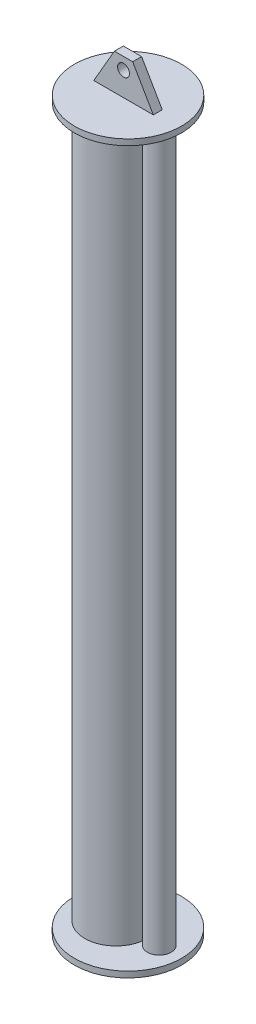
ISO-10303-21;
HEADER;
FILE_DESCRIPTION(('STEP AP214'),'2;1');
FILE_NAME('part.step','',(''),(''),'','','');
FILE_SCHEMA(('AUTOMOTIVE_DESIGN { 1 0 10303 214 1 1 1 1 }'));
ENDSEC;
DATA;
#1=APPLICATION_CONTEXT('core data for automotive mechanical design processes');
#2=APPLICATION_PROTOCOL_DEFINITION('international standard','automotive_design',2000,#1);
#3=PRODUCT_CONTEXT('',#1,'mechanical');
#4=PRODUCT('Part','Part','',(#3));
#5=PRODUCT_RELATED_PRODUCT_CATEGORY('part','',(#4));
#6=PRODUCT_DEFINITION_FORMATION('','',#4);
#7=PRODUCT_DEFINITION_CONTEXT('part definition',#1,'design');
#8=PRODUCT_DEFINITION('design','',#6,#7);
#9=PRODUCT_DEFINITION_SHAPE('','',#8);
#10=(LENGTH_UNIT() NAMED_UNIT(*) SI_UNIT(.MILLI.,.METRE.));
#11=(NAMED_UNIT(*) PLANE_ANGLE_UNIT() SI_UNIT($,.RADIAN.));
#12=(NAMED_UNIT(*) SI_UNIT($,.STERADIAN.) SOLID_ANGLE_UNIT());
#13=UNCERTAINTY_MEASURE_WITH_UNIT(LENGTH_MEASURE(1.E-05),#10,'distance_accuracy_value','');
#14=(GEOMETRIC_REPRESENTATION_CONTEXT(3) GLOBAL_UNCERTAINTY_ASSIGNED_CONTEXT((#13)) GLOBAL_UNIT_ASSIGNED_CONTEXT((#10,
#11,#12)) REPRESENTATION_CONTEXT('',''));
#15=CARTESIAN_POINT('',(0.,0.,0.));
#16=DIRECTION('',(0.,0.,1.));
#17=DIRECTION('',(1.,0.,0.));
#18=AXIS2_PLACEMENT_3D('',#15,#16,#17);
#19=CARTESIAN_POINT('',(-57.5785408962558,1536.7,0.));
#20=DIRECTION('',(0.,1.,0.));
#21=DIRECTION('',(0.,0.,1.));
#22=AXIS2_PLACEMENT_3D('',#19,#20,#21);
#23=PLANE('',#22);
#24=CARTESIAN_POINT('',(-57.5785408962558,1536.7,0.));
#25=DIRECTION('',(0.,1.,0.));
#26=DIRECTION('',(0.,0.,1.));
#27=AXIS2_PLACEMENT_3D('',#24,#25,#26);
#28=CIRCLE('',#27,114.3);
#29=CARTESIAN_POINT('',(-57.5785408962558,1536.7,114.3));
#30=VERTEX_POINT('',#29);
#31=EDGE_CURVE('E148',#30,#30,#28,.T.);
#32=ORIENTED_EDGE('',*,*,#31,.T.);
#33=EDGE_LOOP('',(#32));
#34=FACE_BOUND('',#33,.T.);
#35=DIRECTION('',(1.,0.,0.));
#36=VECTOR('',#35,1.);
#37=CARTESIAN_POINT('',(5.92145910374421,1536.7,9.525));
#38=LINE('',#37,#36);
#39=CARTESIAN_POINT('',(-121.078540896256,1536.7,9.525));
#40=VERTEX_POINT('',#39);
#41=CARTESIAN_POINT('',(5.92145910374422,1536.7,9.525));
#42=VERTEX_POINT('',#41);
#43=EDGE_CURVE('E110',#40,#42,#38,.T.);
#44=ORIENTED_EDGE('',*,*,#43,.F.);
#45=DIRECTION('',(0.,0.,-1.));
#46=VECTOR('',#45,1.);
#47=CARTESIAN_POINT('',(-121.078540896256,1536.7,9.525));
#48=LINE('',#47,#46);
#49=CARTESIAN_POINT('',(-121.078540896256,1536.7,-9.525));
#50=VERTEX_POINT('',#49);
#51=EDGE_CURVE('E121',#40,#50,#48,.T.);
#52=ORIENTED_EDGE('',*,*,#51,.T.);
#53=DIRECTION('',(1.,0.,0.));
#54=VECTOR('',#53,1.);
#55=CARTESIAN_POINT('',(5.92145910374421,1536.7,-9.525));
#56=LINE('',#55,#54);
#57=CARTESIAN_POINT('',(5.92145910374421,1536.7,-9.525));
#58=VERTEX_POINT('',#57);
#59=EDGE_CURVE('E137',#50,#58,#56,.T.);
#60=ORIENTED_EDGE('',*,*,#59,.T.);
#61=DIRECTION('',(0.,0.,-1.));
#62=VECTOR('',#61,1.);
#63=CARTESIAN_POINT('',(5.92145910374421,1536.7,9.525));
#64=LINE('',#63,#62);
#65=EDGE_CURVE('E128',#42,#58,#64,.T.);
#66=ORIENTED_EDGE('',*,*,#65,.F.);
#67=EDGE_LOOP('',(#44,#52,#60,#66));
#68=FACE_BOUND('',#67,.T.);
#69=ADVANCED_FACE('F33',(#34,#68),#23,.T.);
#70=CARTESIAN_POINT('',(-82.9785408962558,1524.,0.));
#71=DIRECTION('',(0.,-1.,0.));
#72=DIRECTION('',(0.,0.,-1.));
#73=AXIS2_PLACEMENT_3D('',#70,#71,#72);
#74=CYLINDRICAL_SURFACE('',#73,66.675);
#75=CARTESIAN_POINT('',(-82.9785408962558,0.,0.));
#76=DIRECTION('',(0.,1.,0.));
#77=DIRECTION('',(0.,0.,1.));
#78=AXIS2_PLACEMENT_3D('',#75,#76,#77);
#79=CIRCLE('',#78,66.675);
#80=CARTESIAN_POINT('',(-16.6691150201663,0.,-6.97249345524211));
#81=VERTEX_POINT('',#80);
#82=CARTESIAN_POINT('',(-16.6691150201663,0.,6.97249345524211));
#83=VERTEX_POINT('',#82);
#84=EDGE_CURVE('E70',#81,#83,#79,.T.);
#85=ORIENTED_EDGE('',*,*,#84,.T.);
#86=DIRECTION('',(0.,-1.,0.));
#87=VECTOR('',#86,1.);
#88=CARTESIAN_POINT('',(-16.6691150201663,1524.,6.97249345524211));
#89=LINE('',#88,#87);
#90=CARTESIAN_POINT('',(-16.6691150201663,1524.,6.97249345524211));
#91=VERTEX_POINT('',#90);
#92=EDGE_CURVE('E11',#91,#83,#89,.T.);
#93=ORIENTED_EDGE('',*,*,#92,.F.);
#94=CARTESIAN_POINT('',(-82.9785408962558,1524.,0.));
#95=DIRECTION('',(0.,1.,0.));
#96=DIRECTION('',(0.,0.,1.));
#97=AXIS2_PLACEMENT_3D('',#94,#95,#96);
#98=CIRCLE('',#97,66.675);
#99=CARTESIAN_POINT('',(-16.6691150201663,1524.,-6.97249345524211));
#100=VERTEX_POINT('',#99);
#101=EDGE_CURVE('E183',#100,#91,#98,.T.);
#102=ORIENTED_EDGE('',*,*,#101,.F.);
#103=DIRECTION('',(0.,-1.,0.));
#104=VECTOR('',#103,1.);
#105=CARTESIAN_POINT('',(-16.6691150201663,1524.,-6.97249345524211));
#106=LINE('',#105,#104);
#107=EDGE_CURVE('E196',#100,#81,#106,.T.);
#108=ORIENTED_EDGE('',*,*,#107,.T.);
#109=EDGE_LOOP('',(#85,#93,#102,#108));
#110=FACE_BOUND('',#109,.T.);
#111=ADVANCED_FACE('F35',(#110),#74,.T.);
#112=CARTESIAN_POINT('',(-16.6691150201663,1524.,6.97249345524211));
#113=DIRECTION('',(0.,0.,-1.));
#114=DIRECTION('',(-1.,0.,0.));
#115=AXIS2_PLACEMENT_3D('',#112,#113,#114);
#116=PLANE('',#115);
#117=DIRECTION('',(1.,0.,0.));
#118=VECTOR('',#117,1.);
#119=CARTESIAN_POINT('',(-16.6691150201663,0.,6.97249345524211));
#120=LINE('',#119,#118);
#121=CARTESIAN_POINT('',(-15.3277979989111,0.,6.97249345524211));
#122=VERTEX_POINT('',#121);
#123=EDGE_CURVE('E77',#83,#122,#120,.T.);
#124=ORIENTED_EDGE('',*,*,#123,.T.);
#125=DIRECTION('',(0.,-1.,0.));
#126=VECTOR('',#125,1.);
#127=CARTESIAN_POINT('',(-15.3277979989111,1524.,6.97249345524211));
#128=LINE('',#127,#126);
#129=CARTESIAN_POINT('',(-15.3277979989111,1524.,6.97249345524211));
#130=VERTEX_POINT('',#129);
#131=EDGE_CURVE('E41',#130,#122,#128,.T.);
#132=ORIENTED_EDGE('',*,*,#131,.F.);
#133=DIRECTION('',(1.,0.,0.));
#134=VECTOR('',#133,1.);
#135=CARTESIAN_POINT('',(-16.6691150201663,1524.,6.97249345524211));
#136=LINE('',#135,#134);
#137=EDGE_CURVE('E186',#91,#130,#136,.T.);
#138=ORIENTED_EDGE('',*,*,#137,.F.);
#139=ORIENTED_EDGE('',*,*,#92,.T.);
#140=EDGE_LOOP('',(#124,#132,#138,#139));
#141=FACE_BOUND('',#140,.T.);
#142=ADVANCED_FACE('F207',(#141),#116,.F.);
#143=CARTESIAN_POINT('',(9.09645910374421,1524.,0.));
#144=DIRECTION('',(0.,-1.,0.));
#145=DIRECTION('',(0.,0.,-1.));
#146=AXIS2_PLACEMENT_3D('',#143,#144,#145);
#147=CYLINDRICAL_SURFACE('',#146,25.4);
#148=CARTESIAN_POINT('',(9.09645910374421,0.,0.));
#149=DIRECTION('',(0.,1.,0.));
#150=DIRECTION('',(0.,0.,1.));
#151=AXIS2_PLACEMENT_3D('',#148,#149,#150);
#152=CIRCLE('',#151,25.4);
#153=CARTESIAN_POINT('',(-15.3277979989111,0.,-6.97249345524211));
#154=VERTEX_POINT('',#153);
#155=EDGE_CURVE('E199',#122,#154,#152,.T.);
#156=ORIENTED_EDGE('',*,*,#155,.T.);
#157=DIRECTION('',(0.,-1.,0.));
#158=VECTOR('',#157,1.);
#159=CARTESIAN_POINT('',(-15.3277979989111,1524.,-6.97249345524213));
#160=LINE('',#159,#158);
#161=CARTESIAN_POINT('',(-15.3277979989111,1524.,-6.97249345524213));
#162=VERTEX_POINT('',#161);
#163=EDGE_CURVE('E57',#162,#154,#160,.T.);
#164=ORIENTED_EDGE('',*,*,#163,.F.);
#165=CARTESIAN_POINT('',(9.09645910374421,1524.,0.));
#166=DIRECTION('',(0.,1.,0.));
#167=DIRECTION('',(0.,0.,1.));
#168=AXIS2_PLACEMENT_3D('',#165,#166,#167);
#169=CIRCLE('',#168,25.4);
#170=EDGE_CURVE('E190',#130,#162,#169,.T.);
#171=ORIENTED_EDGE('',*,*,#170,.F.);
#172=ORIENTED_EDGE('',*,*,#131,.T.);
#173=EDGE_LOOP('',(#156,#164,#171,#172));
#174=FACE_BOUND('',#173,.T.);
#175=ADVANCED_FACE('F205',(#174),#147,.T.);
#176=CARTESIAN_POINT('',(-16.6691150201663,1524.,-6.97249345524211));
#177=DIRECTION('',(0.,0.,1.));
#178=DIRECTION('',(1.,0.,0.));
#179=AXIS2_PLACEMENT_3D('',#176,#177,#178);
#180=PLANE('',#179);
#181=DIRECTION('',(-1.,0.,0.));
#182=VECTOR('',#181,1.);
#183=CARTESIAN_POINT('',(-16.6691150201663,0.,-6.97249345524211));
#184=LINE('',#183,#182);
#185=EDGE_CURVE('E187',#154,#81,#184,.T.);
#186=ORIENTED_EDGE('',*,*,#185,.T.);
#187=ORIENTED_EDGE('',*,*,#107,.F.);
#188=DIRECTION('',(-1.,0.,0.));
#189=VECTOR('',#188,1.);
#190=CARTESIAN_POINT('',(-16.6691150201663,1524.,-6.97249345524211));
#191=LINE('',#190,#189);
#192=EDGE_CURVE('E193',#162,#100,#191,.T.);
#193=ORIENTED_EDGE('',*,*,#192,.F.);
#194=ORIENTED_EDGE('',*,*,#163,.T.);
#195=EDGE_LOOP('',(#186,#187,#193,#194));
#196=FACE_BOUND('',#195,.T.);
#197=ADVANCED_FACE('F212',(#196),#180,.F.);
#198=CARTESIAN_POINT('',(-82.9785408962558,1524.,0.));
#199=DIRECTION('',(0.,-1.,0.));
#200=DIRECTION('',(0.,0.,-1.));
#201=AXIS2_PLACEMENT_3D('',#198,#199,#200);
#202=CYLINDRICAL_SURFACE('',#201,60.325);
#203=CARTESIAN_POINT('',(-82.9785408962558,1524.,0.));
#204=DIRECTION('',(0.,1.,0.));
#205=DIRECTION('',(0.,0.,1.));
#206=AXIS2_PLACEMENT_3D('',#203,#204,#205);
#207=CIRCLE('',#206,60.325);
#208=CARTESIAN_POINT('',(-82.9785408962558,1524.,60.325));
#209=VERTEX_POINT('',#208);
#210=EDGE_CURVE('E156',#209,#209,#207,.T.);
#211=ORIENTED_EDGE('',*,*,#210,.T.);
#212=EDGE_LOOP('',(#211));
#213=FACE_BOUND('',#212,.T.);
#214=CARTESIAN_POINT('',(-82.9785408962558,0.,0.));
#215=DIRECTION('',(0.,1.,0.));
#216=DIRECTION('',(0.,0.,1.));
#217=AXIS2_PLACEMENT_3D('',#214,#215,#216);
#218=CIRCLE('',#217,60.325);
#219=CARTESIAN_POINT('',(-82.9785408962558,0.,60.325));
#220=VERTEX_POINT('',#219);
#221=EDGE_CURVE('E180',#220,#220,#218,.T.);
#222=ORIENTED_EDGE('',*,*,#221,.F.);
#223=EDGE_LOOP('',(#222));
#224=FACE_BOUND('',#223,.T.);
#225=ADVANCED_FACE('F334',(#213,#224),#202,.F.);
#226=CARTESIAN_POINT('',(9.09645910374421,1524.,0.));
#227=DIRECTION('',(0.,-1.,0.));
#228=DIRECTION('',(0.,0.,-1.));
#229=AXIS2_PLACEMENT_3D('',#226,#227,#228);
#230=CYLINDRICAL_SURFACE('',#229,19.05);
#231=CARTESIAN_POINT('',(9.09645910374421,1524.,0.));
#232=DIRECTION('',(0.,1.,0.));
#233=DIRECTION('',(0.,0.,1.));
#234=AXIS2_PLACEMENT_3D('',#231,#232,#233);
#235=CIRCLE('',#234,19.05);
#236=CARTESIAN_POINT('',(9.09645910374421,1524.,19.05));
#237=VERTEX_POINT('',#236);
#238=EDGE_CURVE('E151',#237,#237,#235,.T.);
#239=ORIENTED_EDGE('',*,*,#238,.T.);
#240=EDGE_LOOP('',(#239));
#241=FACE_BOUND('',#240,.T.);
#242=CARTESIAN_POINT('',(9.09645910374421,0.,0.));
#243=DIRECTION('',(0.,1.,0.));
#244=DIRECTION('',(0.,0.,1.));
#245=AXIS2_PLACEMENT_3D('',#242,#243,#244);
#246=CIRCLE('',#245,19.05);
#247=CARTESIAN_POINT('',(9.09645910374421,0.,19.05));
#248=VERTEX_POINT('',#247);
#249=EDGE_CURVE('E175',#248,#248,#246,.T.);
#250=ORIENTED_EDGE('',*,*,#249,.F.);
#251=EDGE_LOOP('',(#250));
#252=FACE_BOUND('',#251,.T.);
#253=ADVANCED_FACE('F423',(#241,#252),#230,.F.);
#254=CARTESIAN_POINT('',(-57.5785408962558,0.,0.));
#255=DIRECTION('',(0.,-1.,0.));
#256=DIRECTION('',(0.,0.,-1.));
#257=AXIS2_PLACEMENT_3D('',#254,#255,#256);
#258=PLANE('',#257);
#259=CARTESIAN_POINT('',(-57.5785408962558,0.,0.));
#260=DIRECTION('',(0.,-1.,0.));
#261=DIRECTION('',(0.,0.,-1.));
#262=AXIS2_PLACEMENT_3D('',#259,#260,#261);
#263=CIRCLE('',#262,114.3);
#264=CARTESIAN_POINT('',(-57.5785408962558,0.,-114.3));
#265=VERTEX_POINT('',#264);
#266=EDGE_CURVE('E169',#265,#265,#263,.T.);
#267=ORIENTED_EDGE('',*,*,#266,.F.);
#268=EDGE_LOOP('',(#267));
#269=FACE_BOUND('',#268,.T.);
#270=ORIENTED_EDGE('',*,*,#123,.F.);
#271=ORIENTED_EDGE('',*,*,#84,.F.);
#272=ORIENTED_EDGE('',*,*,#185,.F.);
#273=ORIENTED_EDGE('',*,*,#155,.F.);
#274=EDGE_LOOP('',(#270,#271,#272,#273));
#275=FACE_BOUND('',#274,.T.);
#276=ADVANCED_FACE('F397',(#269,#275),#258,.F.);
#277=ORIENTED_EDGE('',*,*,#221,.T.);
#278=EDGE_LOOP('',(#277));
#279=FACE_BOUND('',#278,.T.);
#280=CARTESIAN_POINT('',(-82.9785408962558,0.,0.));
#281=DIRECTION('',(0.,-1.,0.));
#282=DIRECTION('',(0.,0.,-1.));
#283=AXIS2_PLACEMENT_3D('',#280,#281,#282);
#284=CIRCLE('',#283,12.7);
#285=CARTESIAN_POINT('',(-82.9785408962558,0.,-12.7));
#286=VERTEX_POINT('',#285);
#287=EDGE_CURVE('E163',#286,#286,#284,.T.);
#288=ORIENTED_EDGE('',*,*,#287,.T.);
#289=EDGE_LOOP('',(#288));
#290=FACE_BOUND('',#289,.T.);
#291=ADVANCED_FACE('F398',(#279,#290),#258,.F.);
#292=CARTESIAN_POINT('',(-57.5785408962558,-12.7,0.));
#293=DIRECTION('',(0.,-1.,0.));
#294=DIRECTION('',(0.,0.,-1.));
#295=AXIS2_PLACEMENT_3D('',#292,#293,#294);
#296=PLANE('',#295);
#297=CARTESIAN_POINT('',(-82.9785408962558,-12.7,0.));
#298=DIRECTION('',(0.,-1.,0.));
#299=DIRECTION('',(0.,0.,-1.));
#300=AXIS2_PLACEMENT_3D('',#297,#298,#299);
#301=CIRCLE('',#300,12.7);
#302=CARTESIAN_POINT('',(-82.9785408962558,-12.7,-12.7));
#303=VERTEX_POINT('',#302);
#304=EDGE_CURVE('E166',#303,#303,#301,.T.);
#305=ORIENTED_EDGE('',*,*,#304,.F.);
#306=EDGE_LOOP('',(#305));
#307=FACE_BOUND('',#306,.T.);
#308=CARTESIAN_POINT('',(-57.5785408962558,-12.7,0.));
#309=DIRECTION('',(0.,-1.,0.));
#310=DIRECTION('',(0.,0.,-1.));
#311=AXIS2_PLACEMENT_3D('',#308,#309,#310);
#312=CIRCLE('',#311,114.3);
#313=CARTESIAN_POINT('',(-57.5785408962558,-12.7,-114.3));
#314=VERTEX_POINT('',#313);
#315=EDGE_CURVE('E172',#314,#314,#312,.T.);
#316=ORIENTED_EDGE('',*,*,#315,.T.);
#317=EDGE_LOOP('',(#316));
#318=FACE_BOUND('',#317,.T.);
#319=CARTESIAN_POINT('',(9.09645910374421,-12.7,0.));
#320=DIRECTION('',(0.,-1.,0.));
#321=DIRECTION('',(0.,0.,-1.));
#322=AXIS2_PLACEMENT_3D('',#319,#320,#321);
#323=CIRCLE('',#322,9.525);
#324=CARTESIAN_POINT('',(9.09645910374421,-12.7,-9.525));
#325=VERTEX_POINT('',#324);
#326=EDGE_CURVE('E160',#325,#325,#323,.T.);
#327=ORIENTED_EDGE('',*,*,#326,.F.);
#328=EDGE_LOOP('',(#327));
#329=FACE_BOUND('',#328,.T.);
#330=ADVANCED_FACE('F394',(#307,#318,#329),#296,.T.);
#331=ORIENTED_EDGE('',*,*,#249,.T.);
#332=EDGE_LOOP('',(#331));
#333=FACE_BOUND('',#332,.T.);
#334=CARTESIAN_POINT('',(9.09645910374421,0.,0.));
#335=DIRECTION('',(0.,-1.,0.));
#336=DIRECTION('',(0.,0.,-1.));
#337=AXIS2_PLACEMENT_3D('',#334,#335,#336);
#338=CIRCLE('',#337,9.525);
#339=CARTESIAN_POINT('',(9.09645910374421,0.,-9.525));
#340=VERTEX_POINT('',#339);
#341=EDGE_CURVE('E159',#340,#340,#338,.T.);
#342=ORIENTED_EDGE('',*,*,#341,.T.);
#343=EDGE_LOOP('',(#342));
#344=FACE_BOUND('',#343,.T.);
#345=ADVANCED_FACE('F384',(#333,#344),#258,.F.);
#346=CARTESIAN_POINT('',(-57.5785408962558,-12.7,0.));
#347=DIRECTION('',(0.,1.,0.));
#348=DIRECTION('',(0.,0.,1.));
#349=AXIS2_PLACEMENT_3D('',#346,#347,#348);
#350=CYLINDRICAL_SURFACE('',#349,114.3);
#351=ORIENTED_EDGE('',*,*,#315,.F.);
#352=EDGE_LOOP('',(#351));
#353=FACE_BOUND('',#352,.T.);
#354=ORIENTED_EDGE('',*,*,#266,.T.);
#355=EDGE_LOOP('',(#354));
#356=FACE_BOUND('',#355,.T.);
#357=ADVANCED_FACE('F374',(#353,#356),#350,.T.);
#358=CARTESIAN_POINT('',(-82.9785408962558,-12.7,0.));
#359=DIRECTION('',(0.,1.,0.));
#360=DIRECTION('',(0.,0.,1.));
#361=AXIS2_PLACEMENT_3D('',#358,#359,#360);
#362=CYLINDRICAL_SURFACE('',#361,12.7);
#363=ORIENTED_EDGE('',*,*,#304,.T.);
#364=EDGE_LOOP('',(#363));
#365=FACE_BOUND('',#364,.T.);
#366=ORIENTED_EDGE('',*,*,#287,.F.);
#367=EDGE_LOOP('',(#366));
#368=FACE_BOUND('',#367,.T.);
#369=ADVANCED_FACE('F364',(#365,#368),#362,.F.);
#370=CARTESIAN_POINT('',(9.09645910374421,-12.7,0.));
#371=DIRECTION('',(0.,1.,0.));
#372=DIRECTION('',(0.,0.,1.));
#373=AXIS2_PLACEMENT_3D('',#370,#371,#372);
#374=CYLINDRICAL_SURFACE('',#373,9.525);
#375=ORIENTED_EDGE('',*,*,#326,.T.);
#376=EDGE_LOOP('',(#375));
#377=FACE_BOUND('',#376,.T.);
#378=ORIENTED_EDGE('',*,*,#341,.F.);
#379=EDGE_LOOP('',(#378));
#380=FACE_BOUND('',#379,.T.);
#381=ADVANCED_FACE('F231',(#377,#380),#374,.F.);
#382=CARTESIAN_POINT('',(-57.5785408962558,1524.,0.));
#383=DIRECTION('',(0.,1.,0.));
#384=DIRECTION('',(0.,0.,1.));
#385=AXIS2_PLACEMENT_3D('',#382,#383,#384);
#386=PLANE('',#385);
#387=ORIENTED_EDGE('',*,*,#238,.F.);
#388=EDGE_LOOP('',(#387));
#389=FACE_BOUND('',#388,.T.);
#390=ADVANCED_FACE('F220',(#389),#386,.F.);
#391=ORIENTED_EDGE('',*,*,#210,.F.);
#392=EDGE_LOOP('',(#391));
#393=FACE_BOUND('',#392,.T.);
#394=ADVANCED_FACE('F217',(#393),#386,.F.);
#395=CARTESIAN_POINT('',(-57.5785408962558,1524.,0.));
#396=DIRECTION('',(0.,1.,0.));
#397=DIRECTION('',(0.,0.,1.));
#398=AXIS2_PLACEMENT_3D('',#395,#396,#397);
#399=CIRCLE('',#398,114.3);
#400=CARTESIAN_POINT('',(-57.5785408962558,1524.,114.3));
#401=VERTEX_POINT('',#400);
#402=EDGE_CURVE('E127',#401,#401,#399,.T.);
#403=ORIENTED_EDGE('',*,*,#402,.F.);
#404=EDGE_LOOP('',(#403));
#405=FACE_BOUND('',#404,.T.);
#406=ORIENTED_EDGE('',*,*,#192,.T.);
#407=ORIENTED_EDGE('',*,*,#101,.T.);
#408=ORIENTED_EDGE('',*,*,#137,.T.);
#409=ORIENTED_EDGE('',*,*,#170,.T.);
#410=EDGE_LOOP('',(#406,#407,#408,#409));
#411=FACE_BOUND('',#410,.T.);
#412=ADVANCED_FACE('F214',(#405,#411),#386,.F.);
#413=CARTESIAN_POINT('',(-57.5785408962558,1536.7,0.));
#414=DIRECTION('',(0.,-1.,0.));
#415=DIRECTION('',(0.,0.,-1.));
#416=AXIS2_PLACEMENT_3D('',#413,#414,#415);
#417=CYLINDRICAL_SURFACE('',#416,114.3);
#418=ORIENTED_EDGE('',*,*,#31,.F.);
#419=EDGE_LOOP('',(#418));
#420=FACE_BOUND('',#419,.T.);
#421=ORIENTED_EDGE('',*,*,#402,.T.);
#422=EDGE_LOOP('',(#421));
#423=FACE_BOUND('',#422,.T.);
#424=ADVANCED_FACE('F216',(#420,#423),#417,.T.);
#425=CARTESIAN_POINT('',(0.,0.,9.525));
#426=DIRECTION('',(0.,0.,-1.));
#427=DIRECTION('',(-1.,0.,0.));
#428=AXIS2_PLACEMENT_3D('',#425,#426,#427);
#429=PLANE('',#428);
#430=DIRECTION('',(-0.500000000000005,-0.866025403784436,0.));
#431=VECTOR('',#430,1.);
#432=CARTESIAN_POINT('',(-121.078540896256,1536.7,9.525));
#433=LINE('',#432,#431);
#434=CARTESIAN_POINT('',(-77.0844503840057,1612.9,9.525));
#435=VERTEX_POINT('',#434);
#436=EDGE_CURVE('E105',#435,#40,#433,.T.);
#437=ORIENTED_EDGE('',*,*,#436,.T.);
#438=ORIENTED_EDGE('',*,*,#43,.T.);
#439=DIRECTION('',(-0.500000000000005,0.866025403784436,0.));
#440=VECTOR('',#439,1.);
#441=CARTESIAN_POINT('',(5.92145910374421,1536.7,9.525));
#442=LINE('',#441,#440);
#443=CARTESIAN_POINT('',(-38.0726314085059,1612.9,9.525));
#444=VERTEX_POINT('',#443);
#445=EDGE_CURVE('E48',#42,#444,#442,.T.);
#446=ORIENTED_EDGE('',*,*,#445,.T.);
#447=DIRECTION('',(-1.,0.,0.));
#448=VECTOR('',#447,1.);
#449=CARTESIAN_POINT('',(-77.0844503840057,1612.9,9.525));
#450=LINE('',#449,#448);
#451=EDGE_CURVE('E113',#444,#435,#450,.T.);
#452=ORIENTED_EDGE('',*,*,#451,.T.);
#453=EDGE_LOOP('',(#437,#438,#446,#452));
#454=FACE_BOUND('',#453,.T.);
#455=CARTESIAN_POINT('',(-57.5785408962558,1587.5,9.525));
#456=DIRECTION('',(0.,0.,1.));
#457=DIRECTION('',(1.,0.,0.));
#458=AXIS2_PLACEMENT_3D('',#455,#456,#457);
#459=CIRCLE('',#458,12.7);
#460=CARTESIAN_POINT('',(-70.2785408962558,1587.5,9.525));
#461=VERTEX_POINT('',#460);
#462=EDGE_CURVE('E138',#461,#461,#459,.T.);
#463=ORIENTED_EDGE('',*,*,#462,.F.);
#464=EDGE_LOOP('',(#463));
#465=FACE_BOUND('',#464,.T.);
#466=ADVANCED_FACE('F107',(#454,#465),#429,.F.);
#467=CARTESIAN_POINT('',(0.,0.,-9.525));
#468=DIRECTION('',(0.,0.,-1.));
#469=DIRECTION('',(-1.,0.,0.));
#470=AXIS2_PLACEMENT_3D('',#467,#468,#469);
#471=PLANE('',#470);
#472=DIRECTION('',(-0.500000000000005,-0.866025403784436,0.));
#473=VECTOR('',#472,1.);
#474=CARTESIAN_POINT('',(-121.078540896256,1536.7,-9.525));
#475=LINE('',#474,#473);
#476=CARTESIAN_POINT('',(-77.0844503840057,1612.9,-9.525));
#477=VERTEX_POINT('',#476);
#478=EDGE_CURVE('E124',#477,#50,#475,.T.);
#479=ORIENTED_EDGE('',*,*,#478,.F.);
#480=DIRECTION('',(-1.,0.,0.));
#481=VECTOR('',#480,1.);
#482=CARTESIAN_POINT('',(-77.0844503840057,1612.9,-9.525));
#483=LINE('',#482,#481);
#484=CARTESIAN_POINT('',(-38.0726314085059,1612.9,-9.525));
#485=VERTEX_POINT('',#484);
#486=EDGE_CURVE('E117',#485,#477,#483,.T.);
#487=ORIENTED_EDGE('',*,*,#486,.F.);
#488=DIRECTION('',(-0.500000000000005,0.866025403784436,0.));
#489=VECTOR('',#488,1.);
#490=CARTESIAN_POINT('',(5.92145910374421,1536.7,-9.525));
#491=LINE('',#490,#489);
#492=EDGE_CURVE('E140',#58,#485,#491,.T.);
#493=ORIENTED_EDGE('',*,*,#492,.F.);
#494=ORIENTED_EDGE('',*,*,#59,.F.);
#495=EDGE_LOOP('',(#479,#487,#493,#494));
#496=FACE_BOUND('',#495,.T.);
#497=CARTESIAN_POINT('',(-57.5785408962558,1587.5,-9.525));
#498=DIRECTION('',(0.,0.,1.));
#499=DIRECTION('',(1.,0.,0.));
#500=AXIS2_PLACEMENT_3D('',#497,#498,#499);
#501=CIRCLE('',#500,12.7);
#502=CARTESIAN_POINT('',(-70.2785408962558,1587.5,-9.525));
#503=VERTEX_POINT('',#502);
#504=EDGE_CURVE('E264',#503,#503,#501,.T.);
#505=ORIENTED_EDGE('',*,*,#504,.T.);
#506=EDGE_LOOP('',(#505));
#507=FACE_BOUND('',#506,.T.);
#508=ADVANCED_FACE('F242',(#496,#507),#471,.T.);
#509=CARTESIAN_POINT('',(-121.078540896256,1536.7,9.525));
#510=DIRECTION('',(0.866025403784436,-0.500000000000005,0.));
#511=DIRECTION('',(0.500000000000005,0.866025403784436,0.));
#512=AXIS2_PLACEMENT_3D('',#509,#510,#511);
#513=PLANE('',#512);
#514=ORIENTED_EDGE('',*,*,#478,.T.);
#515=ORIENTED_EDGE('',*,*,#51,.F.);
#516=ORIENTED_EDGE('',*,*,#436,.F.);
#517=DIRECTION('',(0.,0.,-1.));
#518=VECTOR('',#517,1.);
#519=CARTESIAN_POINT('',(-77.0844503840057,1612.9,9.525));
#520=LINE('',#519,#518);
#521=EDGE_CURVE('E135',#435,#477,#520,.T.);
#522=ORIENTED_EDGE('',*,*,#521,.T.);
#523=EDGE_LOOP('',(#514,#515,#516,#522));
#524=FACE_BOUND('',#523,.T.);
#525=ADVANCED_FACE('F122',(#524),#513,.F.);
#526=CARTESIAN_POINT('',(5.92145910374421,1536.7,9.525));
#527=DIRECTION('',(-0.866025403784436,-0.500000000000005,0.));
#528=DIRECTION('',(0.500000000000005,-0.866025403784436,0.));
#529=AXIS2_PLACEMENT_3D('',#526,#527,#528);
#530=PLANE('',#529);
#531=ORIENTED_EDGE('',*,*,#492,.T.);
#532=DIRECTION('',(0.,0.,-1.));
#533=VECTOR('',#532,1.);
#534=CARTESIAN_POINT('',(-38.0726314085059,1612.9,9.525));
#535=LINE('',#534,#533);
#536=EDGE_CURVE('E144',#444,#485,#535,.T.);
#537=ORIENTED_EDGE('',*,*,#536,.F.);
#538=ORIENTED_EDGE('',*,*,#445,.F.);
#539=ORIENTED_EDGE('',*,*,#65,.T.);
#540=EDGE_LOOP('',(#531,#537,#538,#539));
#541=FACE_BOUND('',#540,.T.);
#542=ADVANCED_FACE('F241',(#541),#530,.F.);
#543=CARTESIAN_POINT('',(-77.0844503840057,1612.9,9.525));
#544=DIRECTION('',(0.,-1.,0.));
#545=DIRECTION('',(0.,0.,-1.));
#546=AXIS2_PLACEMENT_3D('',#543,#544,#545);
#547=PLANE('',#546);
#548=ORIENTED_EDGE('',*,*,#486,.T.);
#549=ORIENTED_EDGE('',*,*,#521,.F.);
#550=ORIENTED_EDGE('',*,*,#451,.F.);
#551=ORIENTED_EDGE('',*,*,#536,.T.);
#552=EDGE_LOOP('',(#548,#549,#550,#551));
#553=FACE_BOUND('',#552,.T.);
#554=ADVANCED_FACE('F245',(#553),#547,.F.);
#555=CARTESIAN_POINT('',(-57.5785408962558,1587.5,9.525));
#556=DIRECTION('',(0.,0.,-1.));
#557=DIRECTION('',(-1.,0.,0.));
#558=AXIS2_PLACEMENT_3D('',#555,#556,#557);
#559=CYLINDRICAL_SURFACE('',#558,12.7);
#560=CARTESIAN_POINT('',(-70.2785408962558,1587.5,9.525));
#561=CARTESIAN_POINT('',(-70.2785408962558,1587.5,9.3265625));
#562=CARTESIAN_POINT('',(-70.2785408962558,1587.5,9.128125));
#563=CARTESIAN_POINT('',(-70.2785408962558,1587.5,8.73125));
#564=CARTESIAN_POINT('',(-70.2785408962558,1587.5,8.5328125));
#565=CARTESIAN_POINT('',(-70.2785408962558,1587.5,8.1359375));
#566=CARTESIAN_POINT('',(-70.2785408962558,1587.5,7.9375));
#567=CARTESIAN_POINT('',(-70.2785408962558,1587.5,7.540625));
#568=CARTESIAN_POINT('',(-70.2785408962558,1587.5,7.3421875));
#569=CARTESIAN_POINT('',(-70.2785408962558,1587.5,6.9453125));
#570=CARTESIAN_POINT('',(-70.2785408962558,1587.5,6.746875));
#571=CARTESIAN_POINT('',(-70.2785408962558,1587.5,6.35));
#572=CARTESIAN_POINT('',(-70.2785408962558,1587.5,6.1515625));
#573=CARTESIAN_POINT('',(-70.2785408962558,1587.5,5.7546875));
#574=CARTESIAN_POINT('',(-70.2785408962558,1587.5,5.55625));
#575=CARTESIAN_POINT('',(-70.2785408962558,1587.5,5.159375));
#576=CARTESIAN_POINT('',(-70.2785408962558,1587.5,4.9609375));
#577=CARTESIAN_POINT('',(-70.2785408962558,1587.5,4.5640625));
#578=CARTESIAN_POINT('',(-70.2785408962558,1587.5,4.365625));
#579=CARTESIAN_POINT('',(-70.2785408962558,1587.5,3.96875));
#580=CARTESIAN_POINT('',(-70.2785408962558,1587.5,3.7703125));
#581=CARTESIAN_POINT('',(-70.2785408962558,1587.5,3.3734375));
#582=CARTESIAN_POINT('',(-70.2785408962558,1587.5,3.175));
#583=CARTESIAN_POINT('',(-70.2785408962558,1587.5,2.778125));
#584=CARTESIAN_POINT('',(-70.2785408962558,1587.5,2.5796875));
#585=CARTESIAN_POINT('',(-70.2785408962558,1587.5,2.1828125));
#586=CARTESIAN_POINT('',(-70.2785408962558,1587.5,1.984375));
#587=CARTESIAN_POINT('',(-70.2785408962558,1587.5,1.5875));
#588=CARTESIAN_POINT('',(-70.2785408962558,1587.5,1.3890625));
#589=CARTESIAN_POINT('',(-70.2785408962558,1587.5,0.992187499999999));
#590=CARTESIAN_POINT('',(-70.2785408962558,1587.5,0.793749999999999));
#591=CARTESIAN_POINT('',(-70.2785408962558,1587.5,0.396874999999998));
#592=CARTESIAN_POINT('',(-70.2785408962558,1587.5,0.198437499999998));
#593=CARTESIAN_POINT('',(-70.2785408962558,1587.5,-0.198437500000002));
#594=CARTESIAN_POINT('',(-70.2785408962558,1587.5,-0.396875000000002));
#595=CARTESIAN_POINT('',(-70.2785408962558,1587.5,-0.793750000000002));
#596=CARTESIAN_POINT('',(-70.2785408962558,1587.5,-0.992187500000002));
#597=CARTESIAN_POINT('',(-70.2785408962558,1587.5,-1.3890625));
#598=CARTESIAN_POINT('',(-70.2785408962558,1587.5,-1.5875));
#599=CARTESIAN_POINT('',(-70.2785408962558,1587.5,-1.984375));
#600=CARTESIAN_POINT('',(-70.2785408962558,1587.5,-2.1828125));
#601=CARTESIAN_POINT('',(-70.2785408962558,1587.5,-2.5796875));
#602=CARTESIAN_POINT('',(-70.2785408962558,1587.5,-2.778125));
#603=CARTESIAN_POINT('',(-70.2785408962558,1587.5,-3.175));
#604=CARTESIAN_POINT('',(-70.2785408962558,1587.5,-3.3734375));
#605=CARTESIAN_POINT('',(-70.2785408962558,1587.5,-3.7703125));
#606=CARTESIAN_POINT('',(-70.2785408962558,1587.5,-3.96875));
#607=CARTESIAN_POINT('',(-70.2785408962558,1587.5,-4.365625));
#608=CARTESIAN_POINT('',(-70.2785408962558,1587.5,-4.5640625));
#609=CARTESIAN_POINT('',(-70.2785408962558,1587.5,-4.9609375));
#610=CARTESIAN_POINT('',(-70.2785408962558,1587.5,-5.159375));
#611=CARTESIAN_POINT('',(-70.2785408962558,1587.5,-5.55625));
#612=CARTESIAN_POINT('',(-70.2785408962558,1587.5,-5.7546875));
#613=CARTESIAN_POINT('',(-70.2785408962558,1587.5,-6.1515625));
#614=CARTESIAN_POINT('',(-70.2785408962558,1587.5,-6.35));
#615=CARTESIAN_POINT('',(-70.2785408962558,1587.5,-6.746875));
#616=CARTESIAN_POINT('',(-70.2785408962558,1587.5,-6.9453125));
#617=CARTESIAN_POINT('',(-70.2785408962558,1587.5,-7.3421875));
#618=CARTESIAN_POINT('',(-70.2785408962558,1587.5,-7.540625));
#619=CARTESIAN_POINT('',(-70.2785408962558,1587.5,-7.9375));
#620=CARTESIAN_POINT('',(-70.2785408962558,1587.5,-8.1359375));
#621=CARTESIAN_POINT('',(-70.2785408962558,1587.5,-8.5328125));
#622=CARTESIAN_POINT('',(-70.2785408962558,1587.5,-8.73125));
#623=CARTESIAN_POINT('',(-70.2785408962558,1587.5,-9.128125));
#624=CARTESIAN_POINT('',(-70.2785408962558,1587.5,-9.3265625));
#625=CARTESIAN_POINT('',(-70.2785408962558,1587.5,-9.525));
#626=B_SPLINE_CURVE_WITH_KNOTS('',3,(#560,#561,#562,#563,#564,#565,#566,#567,#568,#569,#570,
#571,#572,#573,#574,#575,#576,#577,#578,#579,#580,#581,#582,#583,#584,#585,#586,#587,#588,#589,
#590,#591,#592,#593,#594,#595,#596,#597,#598,#599,#600,#601,#602,#603,#604,#605,#606,#607,#608,
#609,#610,#611,#612,#613,#614,#615,#616,#617,#618,#619,#620,#621,#622,#623,#624,#625),
.UNSPECIFIED.,.F.,.F.,(4,2,2,2,2,2,2,2,2,2,2,2,2,2,2,2,2,2,2,2,2,2,2,2,2,2,2,2,2,2,2,2,4),(0.,
0.595312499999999,1.190625,1.7859375,2.38125,2.9765625,3.571875,4.1671875,4.7625,5.3578125,
5.953125,6.5484375,7.14375,7.7390625,8.334375,8.9296875,9.525,10.1203125,10.715625,11.3109375,
11.90625,12.5015625,13.096875,13.6921875,14.2875,14.8828125,15.478125,16.0734375,16.66875,
17.2640625,17.859375,18.4546875,19.05),.UNSPECIFIED.);
#627=EDGE_CURVE('BSEAM248',#461,#503,#626,.T.);
#628=ORIENTED_EDGE('',*,*,#462,.T.);
#629=ORIENTED_EDGE('',*,*,#504,.F.);
#630=ORIENTED_EDGE('',*,*,#627,.T.);
#631=ORIENTED_EDGE('',*,*,#627,.F.);
#632=EDGE_LOOP('',(#628,#630,#629,#631));
#633=FACE_BOUND('',#632,.T.);
#634=ADVANCED_FACE('F248',(#633),#559,.F.);
#635=CLOSED_SHELL('',(#69,#111,#142,#175,#197,#225,#253,#276,#291,#330,#345,#357,#369,#381,#390,
#394,#412,#424,#466,#508,#525,#542,#554,#634));
#636=MANIFOLD_SOLID_BREP('B2',#635);
#637=ADVANCED_BREP_SHAPE_REPRESENTATION('',(#18,#636),#14);
#638=SHAPE_DEFINITION_REPRESENTATION(#9,#637);
ENDSEC;
END-ISO-10303-21;
